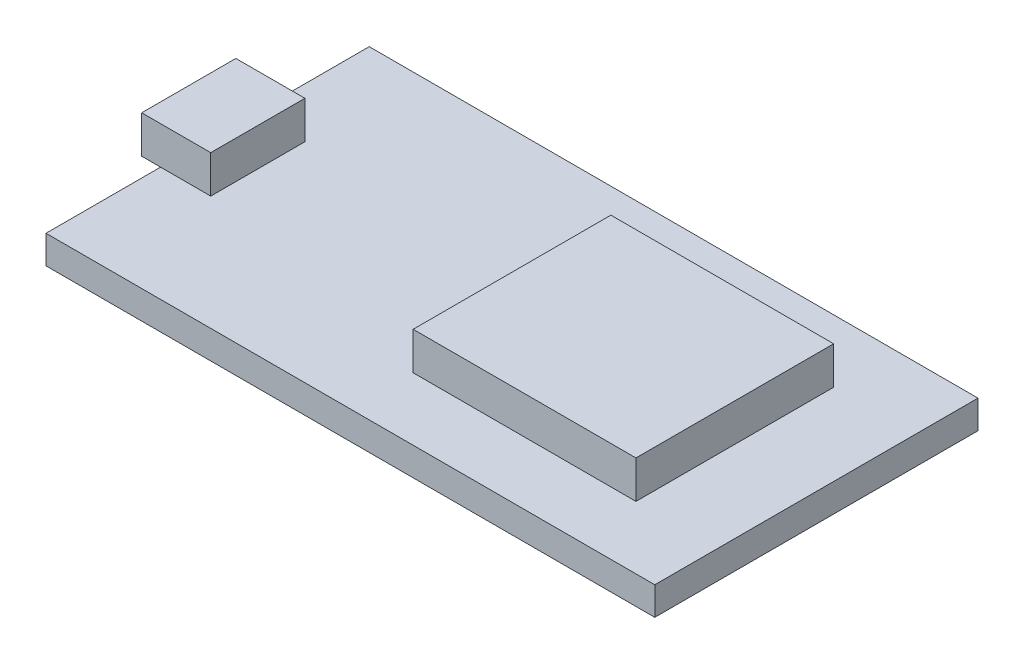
from build123d import *

# Parameters (mm, degrees)
SKETCH2_W           = 48.5
SKETCH2_H           = 25.75
BOSS_EXTRUDE1_DEPTH = 2.25
SKETCH3_W           = 17.75
SKETCH3_H           = 15.75
SKETCH3_W_2         = 5.5
SKETCH3_H_2         = 7.5
BOSS_EXTRUDE2_DEPTH = 3
SHELL1_T            = -0.5


with BuildPart() as part:
    # Sketch2 → Boss-Extrude1 (new body)
    with BuildSketch(Plane(origin=(0, 0, 0), x_dir=(1, 0, 0), z_dir=(0, 1, 0))):
        with Locations((24.25, 12.875)):
            Rectangle(SKETCH2_W, SKETCH2_H)
    extrude(amount=BOSS_EXTRUDE1_DEPTH)

    # Sketch3 → Boss-Extrude2 (add)
    with BuildSketch(Plane(origin=(0, 2.25, 0), x_dir=(1, 0, 0), z_dir=(0, 1, 0))):
        with Locations((33.125, 12.875)):
            Rectangle(SKETCH3_W, SKETCH3_H)
        with Locations((1.25, 12.875)):
            Rectangle(SKETCH3_W_2, SKETCH3_H_2)
    extrude(amount=BOSS_EXTRUDE2_DEPTH)

    # Shell1
    shell1_openings = [part.faces().sort_by_distance(p)[0] for p in [
        (-1.5, 3.75, -12.875),
    ]]
    offset(amount=SHELL1_T, openings=shell1_openings, kind=Kind.INTERSECTION)


solid = part.part
